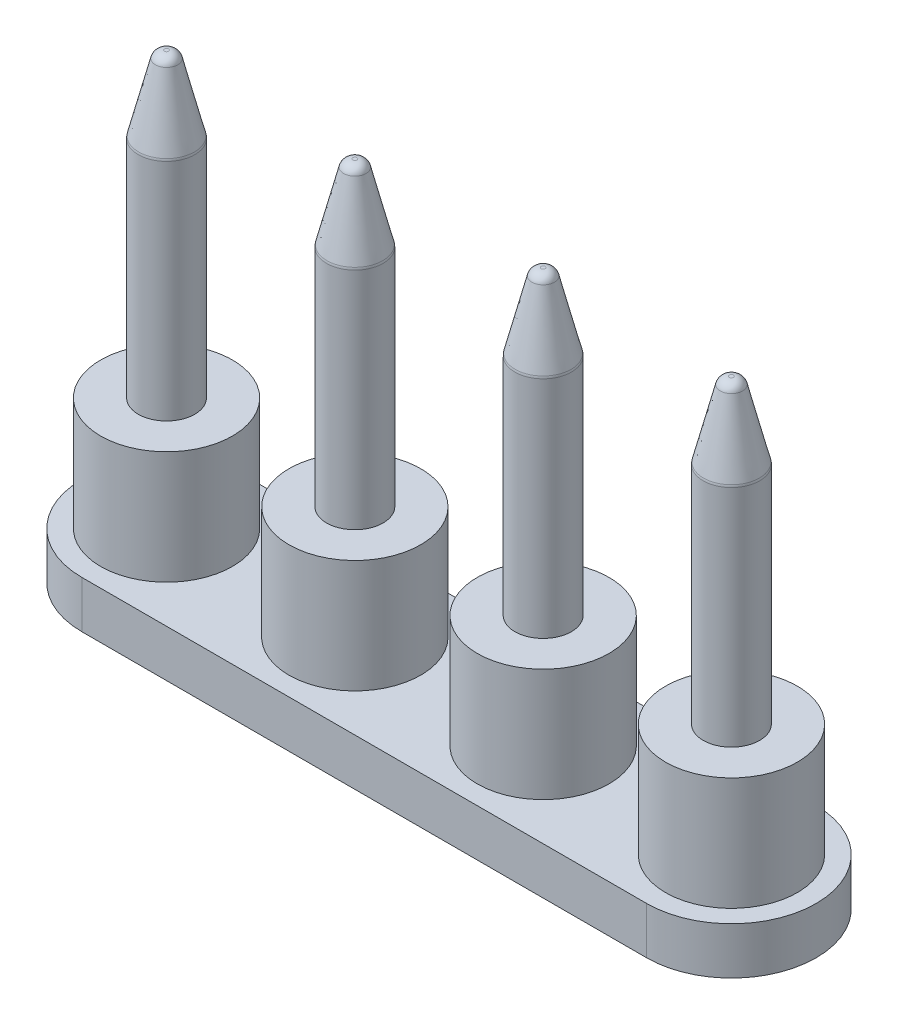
ISO-10303-21;
HEADER;
FILE_DESCRIPTION(('STEP AP214'),'2;1');
FILE_NAME('part.step','',(''),(''),'','','');
FILE_SCHEMA(('AUTOMOTIVE_DESIGN { 1 0 10303 214 1 1 1 1 }'));
ENDSEC;
DATA;
#1=APPLICATION_CONTEXT('core data for automotive mechanical design processes');
#2=APPLICATION_PROTOCOL_DEFINITION('international standard','automotive_design',2000,#1);
#3=PRODUCT_CONTEXT('',#1,'mechanical');
#4=PRODUCT('Part','Part','',(#3));
#5=PRODUCT_RELATED_PRODUCT_CATEGORY('part','',(#4));
#6=PRODUCT_DEFINITION_FORMATION('','',#4);
#7=PRODUCT_DEFINITION_CONTEXT('part definition',#1,'design');
#8=PRODUCT_DEFINITION('design','',#6,#7);
#9=PRODUCT_DEFINITION_SHAPE('','',#8);
#10=(LENGTH_UNIT() NAMED_UNIT(*) SI_UNIT(.MILLI.,.METRE.));
#11=(NAMED_UNIT(*) PLANE_ANGLE_UNIT() SI_UNIT($,.RADIAN.));
#12=(NAMED_UNIT(*) SI_UNIT($,.STERADIAN.) SOLID_ANGLE_UNIT());
#13=UNCERTAINTY_MEASURE_WITH_UNIT(LENGTH_MEASURE(1.E-05),#10,'distance_accuracy_value','');
#14=(GEOMETRIC_REPRESENTATION_CONTEXT(3) GLOBAL_UNCERTAINTY_ASSIGNED_CONTEXT((#13)) GLOBAL_UNIT_ASSIGNED_CONTEXT((#10,
#11,#12)) REPRESENTATION_CONTEXT('',''));
#15=CARTESIAN_POINT('',(0.,0.,0.));
#16=DIRECTION('',(0.,0.,1.));
#17=DIRECTION('',(1.,0.,0.));
#18=AXIS2_PLACEMENT_3D('',#15,#16,#17);
#19=CARTESIAN_POINT('',(15.,8.50000000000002,0.));
#20=DIRECTION('',(0.,1.,0.));
#21=DIRECTION('',(0.,0.,1.));
#22=AXIS2_PLACEMENT_3D('',#19,#20,#21);
#23=PLANE('',#22);
#24=CARTESIAN_POINT('',(15.,8.50000000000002,0.));
#25=DIRECTION('',(0.,1.,0.));
#26=DIRECTION('',(0.,0.,1.));
#27=AXIS2_PLACEMENT_3D('',#24,#25,#26);
#28=CIRCLE('',#27,3.5);
#29=CARTESIAN_POINT('',(15.,8.50000000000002,3.5));
#30=VERTEX_POINT('',#29);
#31=EDGE_CURVE('E142',#30,#30,#28,.T.);
#32=ORIENTED_EDGE('',*,*,#31,.T.);
#33=EDGE_LOOP('',(#32));
#34=FACE_BOUND('',#33,.T.);
#35=CARTESIAN_POINT('',(15.,8.50000000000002,0.));
#36=DIRECTION('',(0.,1.,0.));
#37=DIRECTION('',(0.,0.,1.));
#38=AXIS2_PLACEMENT_3D('',#35,#36,#37);
#39=CIRCLE('',#38,1.5);
#40=CARTESIAN_POINT('',(15.,8.50000000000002,1.5));
#41=VERTEX_POINT('',#40);
#42=EDGE_CURVE('E106',#41,#41,#39,.T.);
#43=ORIENTED_EDGE('',*,*,#42,.F.);
#44=EDGE_LOOP('',(#43));
#45=FACE_BOUND('',#44,.T.);
#46=ADVANCED_FACE('F31',(#34,#45),#23,.T.);
#47=CARTESIAN_POINT('',(-15.,2.5,-4.50000000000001));
#48=DIRECTION('',(0.,0.,1.));
#49=DIRECTION('',(1.,0.,0.));
#50=AXIS2_PLACEMENT_3D('',#47,#48,#49);
#51=PLANE('',#50);
#52=DIRECTION('',(-1.,0.,0.));
#53=VECTOR('',#52,1.);
#54=CARTESIAN_POINT('',(-15.,2.5,-4.50000000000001));
#55=LINE('',#54,#53);
#56=CARTESIAN_POINT('',(-2.9999803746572,2.5,-4.5));
#57=VERTEX_POINT('',#56);
#58=CARTESIAN_POINT('',(-15.,2.5,-4.50000000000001));
#59=VERTEX_POINT('',#58);
#60=EDGE_CURVE('E46',#57,#59,#55,.T.);
#61=ORIENTED_EDGE('',*,*,#60,.F.);
#62=DIRECTION('',(0.,-1.,0.));
#63=VECTOR('',#62,1.);
#64=CARTESIAN_POINT('',(-2.9999803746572,2.5,-4.5));
#65=LINE('',#64,#63);
#66=CARTESIAN_POINT('',(-2.9999803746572,0.,-4.5));
#67=VERTEX_POINT('',#66);
#68=EDGE_CURVE('E97',#57,#67,#65,.T.);
#69=ORIENTED_EDGE('',*,*,#68,.T.);
#70=DIRECTION('',(-1.,0.,0.));
#71=VECTOR('',#70,1.);
#72=CARTESIAN_POINT('',(-15.,0.,-4.5));
#73=LINE('',#72,#71);
#74=CARTESIAN_POINT('',(-15.,0.,-4.5));
#75=VERTEX_POINT('',#74);
#76=EDGE_CURVE('E86',#67,#75,#73,.T.);
#77=ORIENTED_EDGE('',*,*,#76,.T.);
#78=DIRECTION('',(0.,-1.,0.));
#79=VECTOR('',#78,1.);
#80=CARTESIAN_POINT('',(-15.,2.5,-4.50000000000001));
#81=LINE('',#80,#79);
#82=EDGE_CURVE('E158',#59,#75,#81,.T.);
#83=ORIENTED_EDGE('',*,*,#82,.F.);
#84=EDGE_LOOP('',(#61,#69,#77,#83));
#85=FACE_BOUND('',#84,.T.);
#86=ADVANCED_FACE('F98',(#85),#51,.F.);
#87=CARTESIAN_POINT('',(-15.,8.5,0.));
#88=DIRECTION('',(0.,1.,0.));
#89=DIRECTION('',(0.,0.,1.));
#90=AXIS2_PLACEMENT_3D('',#87,#88,#89);
#91=PLANE('',#90);
#92=CARTESIAN_POINT('',(-15.,8.5,0.));
#93=DIRECTION('',(0.,1.,0.));
#94=DIRECTION('',(0.,0.,1.));
#95=AXIS2_PLACEMENT_3D('',#92,#93,#94);
#96=CIRCLE('',#95,3.5);
#97=CARTESIAN_POINT('',(-15.,8.5,3.49999999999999));
#98=VERTEX_POINT('',#97);
#99=EDGE_CURVE('E136',#98,#98,#96,.T.);
#100=ORIENTED_EDGE('',*,*,#99,.T.);
#101=EDGE_LOOP('',(#100));
#102=FACE_BOUND('',#101,.T.);
#103=CARTESIAN_POINT('',(-15.,8.5,0.));
#104=DIRECTION('',(0.,1.,0.));
#105=DIRECTION('',(0.,0.,1.));
#106=AXIS2_PLACEMENT_3D('',#103,#104,#105);
#107=CIRCLE('',#106,1.5);
#108=CARTESIAN_POINT('',(-15.,8.5,1.49999999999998));
#109=VERTEX_POINT('',#108);
#110=EDGE_CURVE('E102',#109,#109,#107,.T.);
#111=ORIENTED_EDGE('',*,*,#110,.F.);
#112=EDGE_LOOP('',(#111));
#113=FACE_BOUND('',#112,.T.);
#114=ADVANCED_FACE('F232',(#102,#113),#91,.T.);
#115=CARTESIAN_POINT('',(-5.,8.5,0.));
#116=DIRECTION('',(0.,1.,0.));
#117=DIRECTION('',(0.,0.,1.));
#118=AXIS2_PLACEMENT_3D('',#115,#116,#117);
#119=PLANE('',#118);
#120=CARTESIAN_POINT('',(-5.,8.5,0.));
#121=DIRECTION('',(0.,1.,0.));
#122=DIRECTION('',(0.,0.,1.));
#123=AXIS2_PLACEMENT_3D('',#120,#121,#122);
#124=CIRCLE('',#123,3.5);
#125=CARTESIAN_POINT('',(-5.,8.5,3.5));
#126=VERTEX_POINT('',#125);
#127=EDGE_CURVE('E124',#126,#126,#124,.T.);
#128=ORIENTED_EDGE('',*,*,#127,.T.);
#129=EDGE_LOOP('',(#128));
#130=FACE_BOUND('',#129,.T.);
#131=CARTESIAN_POINT('',(-5.,8.5,0.));
#132=DIRECTION('',(0.,1.,0.));
#133=DIRECTION('',(0.,0.,1.));
#134=AXIS2_PLACEMENT_3D('',#131,#132,#133);
#135=CIRCLE('',#134,1.5);
#136=CARTESIAN_POINT('',(-5.,8.5,1.5));
#137=VERTEX_POINT('',#136);
#138=EDGE_CURVE('E115',#137,#137,#135,.T.);
#139=ORIENTED_EDGE('',*,*,#138,.F.);
#140=EDGE_LOOP('',(#139));
#141=FACE_BOUND('',#140,.T.);
#142=ADVANCED_FACE('F234',(#130,#141),#119,.T.);
#143=CARTESIAN_POINT('',(5.00000000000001,8.5,0.));
#144=DIRECTION('',(0.,1.,0.));
#145=DIRECTION('',(0.,0.,1.));
#146=AXIS2_PLACEMENT_3D('',#143,#144,#145);
#147=PLANE('',#146);
#148=CARTESIAN_POINT('',(5.00000000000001,8.5,0.));
#149=DIRECTION('',(0.,1.,0.));
#150=DIRECTION('',(0.,0.,1.));
#151=AXIS2_PLACEMENT_3D('',#148,#149,#150);
#152=CIRCLE('',#151,3.5);
#153=CARTESIAN_POINT('',(5.00000000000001,8.5,3.5));
#154=VERTEX_POINT('',#153);
#155=EDGE_CURVE('E130',#154,#154,#152,.T.);
#156=ORIENTED_EDGE('',*,*,#155,.T.);
#157=EDGE_LOOP('',(#156));
#158=FACE_BOUND('',#157,.T.);
#159=CARTESIAN_POINT('',(5.00000000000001,8.5,0.));
#160=DIRECTION('',(0.,1.,0.));
#161=DIRECTION('',(0.,0.,1.));
#162=AXIS2_PLACEMENT_3D('',#159,#160,#161);
#163=CIRCLE('',#162,1.5);
#164=CARTESIAN_POINT('',(5.00000000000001,8.5,1.5));
#165=VERTEX_POINT('',#164);
#166=EDGE_CURVE('E118',#165,#165,#163,.T.);
#167=ORIENTED_EDGE('',*,*,#166,.F.);
#168=EDGE_LOOP('',(#167));
#169=FACE_BOUND('',#168,.T.);
#170=ADVANCED_FACE('F241',(#158,#169),#147,.T.);
#171=CARTESIAN_POINT('',(-15.,2.5,0.));
#172=DIRECTION('',(0.,1.,0.));
#173=DIRECTION('',(0.,0.,1.));
#174=AXIS2_PLACEMENT_3D('',#171,#172,#173);
#175=PLANE('',#174);
#176=CARTESIAN_POINT('',(5.,2.5,0.));
#177=DIRECTION('',(0.,1.,0.));
#178=DIRECTION('',(0.,0.,1.));
#179=AXIS2_PLACEMENT_3D('',#176,#177,#178);
#180=CIRCLE('',#179,3.5);
#181=CARTESIAN_POINT('',(5.,2.5,3.5));
#182=VERTEX_POINT('',#181);
#183=EDGE_CURVE('E127',#182,#182,#180,.T.);
#184=ORIENTED_EDGE('',*,*,#183,.F.);
#185=EDGE_LOOP('',(#184));
#186=FACE_BOUND('',#185,.T.);
#187=CARTESIAN_POINT('',(15.,2.5,0.));
#188=DIRECTION('',(0.,1.,0.));
#189=DIRECTION('',(0.,0.,1.));
#190=AXIS2_PLACEMENT_3D('',#187,#188,#189);
#191=CIRCLE('',#190,3.5);
#192=CARTESIAN_POINT('',(15.,2.5,3.5));
#193=VERTEX_POINT('',#192);
#194=EDGE_CURVE('E139',#193,#193,#191,.T.);
#195=ORIENTED_EDGE('',*,*,#194,.F.);
#196=EDGE_LOOP('',(#195));
#197=FACE_BOUND('',#196,.T.);
#198=CARTESIAN_POINT('',(-15.,2.5,0.));
#199=DIRECTION('',(0.,1.,0.));
#200=DIRECTION('',(0.,0.,1.));
#201=AXIS2_PLACEMENT_3D('',#198,#199,#200);
#202=CIRCLE('',#201,4.5);
#203=CARTESIAN_POINT('',(-15.,2.5,4.5));
#204=VERTEX_POINT('',#203);
#205=EDGE_CURVE('E149',#59,#204,#202,.T.);
#206=ORIENTED_EDGE('',*,*,#205,.T.);
#207=DIRECTION('',(1.,0.,0.));
#208=VECTOR('',#207,1.);
#209=CARTESIAN_POINT('',(-15.,2.5,4.5));
#210=LINE('',#209,#208);
#211=CARTESIAN_POINT('',(15.,2.5,4.5));
#212=VERTEX_POINT('',#211);
#213=EDGE_CURVE('E152',#204,#212,#210,.T.);
#214=ORIENTED_EDGE('',*,*,#213,.T.);
#215=CARTESIAN_POINT('',(15.,2.5,0.));
#216=DIRECTION('',(0.,1.,0.));
#217=DIRECTION('',(0.,0.,-1.));
#218=AXIS2_PLACEMENT_3D('',#215,#216,#217);
#219=CIRCLE('',#218,4.5);
#220=CARTESIAN_POINT('',(15.,2.5,-4.5));
#221=VERTEX_POINT('',#220);
#222=EDGE_CURVE('E154',#212,#221,#219,.T.);
#223=ORIENTED_EDGE('',*,*,#222,.T.);
#224=CARTESIAN_POINT('',(2.9999803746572,2.5,-4.5));
#225=VERTEX_POINT('',#224);
#226=EDGE_CURVE('E156',#221,#225,#55,.T.);
#227=ORIENTED_EDGE('',*,*,#226,.T.);
#228=CARTESIAN_POINT('',(0.,2.5,-4.51085134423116));
#229=DIRECTION('',(0.,-1.,0.));
#230=DIRECTION('',(0.,0.,1.));
#231=AXIS2_PLACEMENT_3D('',#228,#229,#230);
#232=CIRCLE('',#231,3.);
#233=EDGE_CURVE('E105',#57,#225,#232,.T.);
#234=ORIENTED_EDGE('',*,*,#233,.F.);
#235=ORIENTED_EDGE('',*,*,#60,.T.);
#236=EDGE_LOOP('',(#206,#214,#223,#227,#234,#235));
#237=FACE_BOUND('',#236,.T.);
#238=CARTESIAN_POINT('',(-15.,2.5,0.));
#239=DIRECTION('',(0.,1.,0.));
#240=DIRECTION('',(0.,0.,1.));
#241=AXIS2_PLACEMENT_3D('',#238,#239,#240);
#242=CIRCLE('',#241,3.5);
#243=CARTESIAN_POINT('',(-15.,2.5,3.49999999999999));
#244=VERTEX_POINT('',#243);
#245=EDGE_CURVE('E133',#244,#244,#242,.T.);
#246=ORIENTED_EDGE('',*,*,#245,.F.);
#247=EDGE_LOOP('',(#246));
#248=FACE_BOUND('',#247,.T.);
#249=CARTESIAN_POINT('',(-5.,2.5,0.));
#250=DIRECTION('',(0.,1.,0.));
#251=DIRECTION('',(0.,0.,1.));
#252=AXIS2_PLACEMENT_3D('',#249,#250,#251);
#253=CIRCLE('',#252,3.5);
#254=CARTESIAN_POINT('',(-5.,2.5,3.5));
#255=VERTEX_POINT('',#254);
#256=EDGE_CURVE('E121',#255,#255,#253,.T.);
#257=ORIENTED_EDGE('',*,*,#256,.F.);
#258=EDGE_LOOP('',(#257));
#259=FACE_BOUND('',#258,.T.);
#260=ADVANCED_FACE('F262',(#186,#197,#237,#248,#259),#175,.T.);
#261=CARTESIAN_POINT('',(-15.,2.5,0.));
#262=DIRECTION('',(0.,-1.,0.));
#263=DIRECTION('',(0.,0.,-1.));
#264=AXIS2_PLACEMENT_3D('',#261,#262,#263);
#265=CYLINDRICAL_SURFACE('',#264,4.5);
#266=CARTESIAN_POINT('',(-15.,0.,0.));
#267=DIRECTION('',(0.,1.,0.));
#268=DIRECTION('',(0.,0.,1.));
#269=AXIS2_PLACEMENT_3D('',#266,#267,#268);
#270=CIRCLE('',#269,4.5);
#271=CARTESIAN_POINT('',(-15.,0.,4.5));
#272=VERTEX_POINT('',#271);
#273=EDGE_CURVE('E92',#75,#272,#270,.T.);
#274=ORIENTED_EDGE('',*,*,#273,.T.);
#275=DIRECTION('',(0.,-1.,0.));
#276=VECTOR('',#275,1.);
#277=CARTESIAN_POINT('',(-15.,2.5,4.5));
#278=LINE('',#277,#276);
#279=EDGE_CURVE('E166',#204,#272,#278,.T.);
#280=ORIENTED_EDGE('',*,*,#279,.F.);
#281=ORIENTED_EDGE('',*,*,#205,.F.);
#282=ORIENTED_EDGE('',*,*,#82,.T.);
#283=EDGE_LOOP('',(#274,#280,#281,#282));
#284=FACE_BOUND('',#283,.T.);
#285=ADVANCED_FACE('F33',(#284),#265,.T.);
#286=CARTESIAN_POINT('',(-15.,2.5,4.5));
#287=DIRECTION('',(0.,0.,-1.));
#288=DIRECTION('',(-1.,0.,0.));
#289=AXIS2_PLACEMENT_3D('',#286,#287,#288);
#290=PLANE('',#289);
#291=DIRECTION('',(1.,0.,0.));
#292=VECTOR('',#291,1.);
#293=CARTESIAN_POINT('',(-15.,0.,4.5));
#294=LINE('',#293,#292);
#295=CARTESIAN_POINT('',(15.,0.,4.5));
#296=VERTEX_POINT('',#295);
#297=EDGE_CURVE('E146',#272,#296,#294,.T.);
#298=ORIENTED_EDGE('',*,*,#297,.T.);
#299=DIRECTION('',(0.,-1.,0.));
#300=VECTOR('',#299,1.);
#301=CARTESIAN_POINT('',(15.,2.5,4.5));
#302=LINE('',#301,#300);
#303=EDGE_CURVE('E163',#212,#296,#302,.T.);
#304=ORIENTED_EDGE('',*,*,#303,.F.);
#305=ORIENTED_EDGE('',*,*,#213,.F.);
#306=ORIENTED_EDGE('',*,*,#279,.T.);
#307=EDGE_LOOP('',(#298,#304,#305,#306));
#308=FACE_BOUND('',#307,.T.);
#309=ADVANCED_FACE('F269',(#308),#290,.F.);
#310=CARTESIAN_POINT('',(15.,2.5,0.));
#311=DIRECTION('',(0.,-1.,0.));
#312=DIRECTION('',(0.,0.,-1.));
#313=AXIS2_PLACEMENT_3D('',#310,#311,#312);
#314=CYLINDRICAL_SURFACE('',#313,4.5);
#315=CARTESIAN_POINT('',(15.,0.,0.));
#316=DIRECTION('',(0.,1.,0.));
#317=DIRECTION('',(0.,0.,-1.));
#318=AXIS2_PLACEMENT_3D('',#315,#316,#317);
#319=CIRCLE('',#318,4.5);
#320=CARTESIAN_POINT('',(15.,0.,-4.5));
#321=VERTEX_POINT('',#320);
#322=EDGE_CURVE('E95',#296,#321,#319,.T.);
#323=ORIENTED_EDGE('',*,*,#322,.T.);
#324=DIRECTION('',(0.,-1.,0.));
#325=VECTOR('',#324,1.);
#326=CARTESIAN_POINT('',(15.,2.5,-4.5));
#327=LINE('',#326,#325);
#328=EDGE_CURVE('E160',#221,#321,#327,.T.);
#329=ORIENTED_EDGE('',*,*,#328,.F.);
#330=ORIENTED_EDGE('',*,*,#222,.F.);
#331=ORIENTED_EDGE('',*,*,#303,.T.);
#332=EDGE_LOOP('',(#323,#329,#330,#331));
#333=FACE_BOUND('',#332,.T.);
#334=ADVANCED_FACE('F267',(#333),#314,.T.);
#335=CARTESIAN_POINT('',(2.9999803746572,0.,-4.5));
#336=VERTEX_POINT('',#335);
#337=EDGE_CURVE('E94',#321,#336,#73,.T.);
#338=ORIENTED_EDGE('',*,*,#337,.T.);
#339=DIRECTION('',(0.,-1.,0.));
#340=VECTOR('',#339,1.);
#341=CARTESIAN_POINT('',(2.9999803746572,2.5,-4.5));
#342=LINE('',#341,#340);
#343=EDGE_CURVE('E54',#225,#336,#342,.T.);
#344=ORIENTED_EDGE('',*,*,#343,.F.);
#345=ORIENTED_EDGE('',*,*,#226,.F.);
#346=ORIENTED_EDGE('',*,*,#328,.T.);
#347=EDGE_LOOP('',(#338,#344,#345,#346));
#348=FACE_BOUND('',#347,.T.);
#349=ADVANCED_FACE('F245',(#348),#51,.F.);
#350=CARTESIAN_POINT('',(-15.,0.,0.));
#351=DIRECTION('',(0.,1.,0.));
#352=DIRECTION('',(0.,0.,1.));
#353=AXIS2_PLACEMENT_3D('',#350,#351,#352);
#354=PLANE('',#353);
#355=ORIENTED_EDGE('',*,*,#273,.F.);
#356=ORIENTED_EDGE('',*,*,#76,.F.);
#357=CARTESIAN_POINT('',(0.,0.,-4.51085134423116));
#358=DIRECTION('',(0.,-1.,0.));
#359=DIRECTION('',(0.,0.,1.));
#360=AXIS2_PLACEMENT_3D('',#357,#358,#359);
#361=CIRCLE('',#360,3.);
#362=EDGE_CURVE('E90',#67,#336,#361,.T.);
#363=ORIENTED_EDGE('',*,*,#362,.T.);
#364=ORIENTED_EDGE('',*,*,#337,.F.);
#365=ORIENTED_EDGE('',*,*,#322,.F.);
#366=ORIENTED_EDGE('',*,*,#297,.F.);
#367=EDGE_LOOP('',(#355,#356,#363,#364,#365,#366));
#368=FACE_BOUND('',#367,.T.);
#369=ADVANCED_FACE('F87',(#368),#354,.F.);
#370=CARTESIAN_POINT('',(15.,8.50000000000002,0.));
#371=DIRECTION('',(0.,-1.,0.));
#372=DIRECTION('',(0.,0.,-1.));
#373=AXIS2_PLACEMENT_3D('',#370,#371,#372);
#374=CYLINDRICAL_SURFACE('',#373,3.5);
#375=ORIENTED_EDGE('',*,*,#31,.F.);
#376=EDGE_LOOP('',(#375));
#377=FACE_BOUND('',#376,.T.);
#378=ORIENTED_EDGE('',*,*,#194,.T.);
#379=EDGE_LOOP('',(#378));
#380=FACE_BOUND('',#379,.T.);
#381=ADVANCED_FACE('F256',(#377,#380),#374,.T.);
#382=CARTESIAN_POINT('',(-15.,8.5,0.));
#383=DIRECTION('',(0.,-1.,0.));
#384=DIRECTION('',(0.,0.,-1.));
#385=AXIS2_PLACEMENT_3D('',#382,#383,#384);
#386=CYLINDRICAL_SURFACE('',#385,3.5);
#387=ORIENTED_EDGE('',*,*,#99,.F.);
#388=EDGE_LOOP('',(#387));
#389=FACE_BOUND('',#388,.T.);
#390=ORIENTED_EDGE('',*,*,#245,.T.);
#391=EDGE_LOOP('',(#390));
#392=FACE_BOUND('',#391,.T.);
#393=ADVANCED_FACE('F255',(#389,#392),#386,.T.);
#394=CARTESIAN_POINT('',(5.00000000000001,8.5,0.));
#395=DIRECTION('',(0.,-1.,0.));
#396=DIRECTION('',(0.,0.,-1.));
#397=AXIS2_PLACEMENT_3D('',#394,#395,#396);
#398=CYLINDRICAL_SURFACE('',#397,3.5);
#399=ORIENTED_EDGE('',*,*,#155,.F.);
#400=EDGE_LOOP('',(#399));
#401=FACE_BOUND('',#400,.T.);
#402=ORIENTED_EDGE('',*,*,#183,.T.);
#403=EDGE_LOOP('',(#402));
#404=FACE_BOUND('',#403,.T.);
#405=ADVANCED_FACE('F292',(#401,#404),#398,.T.);
#406=CARTESIAN_POINT('',(-5.,8.5,0.));
#407=DIRECTION('',(0.,-1.,0.));
#408=DIRECTION('',(0.,0.,-1.));
#409=AXIS2_PLACEMENT_3D('',#406,#407,#408);
#410=CYLINDRICAL_SURFACE('',#409,3.5);
#411=ORIENTED_EDGE('',*,*,#127,.F.);
#412=EDGE_LOOP('',(#411));
#413=FACE_BOUND('',#412,.T.);
#414=ORIENTED_EDGE('',*,*,#256,.T.);
#415=EDGE_LOOP('',(#414));
#416=FACE_BOUND('',#415,.T.);
#417=ADVANCED_FACE('F289',(#413,#416),#410,.T.);
#418=CARTESIAN_POINT('',(5.00000000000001,24.5,0.));
#419=DIRECTION('',(0.,-1.,0.));
#420=DIRECTION('',(0.,0.,-1.));
#421=AXIS2_PLACEMENT_3D('',#418,#419,#420);
#422=CYLINDRICAL_SURFACE('',#421,1.5);
#423=CARTESIAN_POINT('',(5.00000000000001,20.4384471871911,0.));
#424=DIRECTION('',(0.,1.,0.));
#425=DIRECTION('',(0.,0.,1.));
#426=AXIS2_PLACEMENT_3D('',#423,#424,#425);
#427=CIRCLE('',#426,1.5);
#428=CARTESIAN_POINT('',(5.00000000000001,20.4384471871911,1.5));
#429=VERTEX_POINT('',#428);
#430=EDGE_CURVE('E178',#429,#429,#427,.F.);
#431=ORIENTED_EDGE('',*,*,#430,.T.);
#432=EDGE_LOOP('',(#431));
#433=FACE_BOUND('',#432,.T.);
#434=ORIENTED_EDGE('',*,*,#166,.T.);
#435=EDGE_LOOP('',(#434));
#436=FACE_BOUND('',#435,.T.);
#437=ADVANCED_FACE('F291',(#433,#436),#422,.T.);
#438=CARTESIAN_POINT('',(5.00000000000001,24.5,0.));
#439=DIRECTION('',(0.,1.,0.));
#440=DIRECTION('',(0.,0.,1.));
#441=AXIS2_PLACEMENT_3D('',#438,#439,#440);
#442=PLANE('',#441);
#443=CARTESIAN_POINT('',(5.00000000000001,24.5,0.));
#444=DIRECTION('',(0.,1.,0.));
#445=DIRECTION('',(0.,0.,1.));
#446=AXIS2_PLACEMENT_3D('',#443,#444,#445);
#447=CIRCLE('',#446,0.109611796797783);
#448=CARTESIAN_POINT('',(5.00000000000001,24.5,0.109611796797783));
#449=VERTEX_POINT('',#448);
#450=EDGE_CURVE('E199',#449,#449,#447,.T.);
#451=ORIENTED_EDGE('',*,*,#450,.T.);
#452=EDGE_LOOP('',(#451));
#453=FACE_BOUND('',#452,.T.);
#454=ADVANCED_FACE('F299',(#453),#442,.T.);
#455=CARTESIAN_POINT('',(-4.99999999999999,24.5,0.));
#456=DIRECTION('',(0.,-1.,0.));
#457=DIRECTION('',(0.,0.,-1.));
#458=AXIS2_PLACEMENT_3D('',#455,#456,#457);
#459=CYLINDRICAL_SURFACE('',#458,1.5);
#460=CARTESIAN_POINT('',(-4.99999999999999,20.4384471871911,0.));
#461=DIRECTION('',(0.,1.,0.));
#462=DIRECTION('',(0.,0.,1.));
#463=AXIS2_PLACEMENT_3D('',#460,#461,#462);
#464=CIRCLE('',#463,1.5);
#465=CARTESIAN_POINT('',(-4.99999999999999,20.4384471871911,1.5));
#466=VERTEX_POINT('',#465);
#467=EDGE_CURVE('E169',#466,#466,#464,.F.);
#468=ORIENTED_EDGE('',*,*,#467,.T.);
#469=EDGE_LOOP('',(#468));
#470=FACE_BOUND('',#469,.T.);
#471=ORIENTED_EDGE('',*,*,#138,.T.);
#472=EDGE_LOOP('',(#471));
#473=FACE_BOUND('',#472,.T.);
#474=ADVANCED_FACE('F490',(#470,#473),#459,.T.);
#475=CARTESIAN_POINT('',(-4.99999999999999,24.5,0.));
#476=DIRECTION('',(0.,1.,0.));
#477=DIRECTION('',(0.,0.,1.));
#478=AXIS2_PLACEMENT_3D('',#475,#476,#477);
#479=PLANE('',#478);
#480=CARTESIAN_POINT('',(-4.99999999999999,24.5,0.));
#481=DIRECTION('',(0.,1.,0.));
#482=DIRECTION('',(0.,0.,1.));
#483=AXIS2_PLACEMENT_3D('',#480,#481,#482);
#484=CIRCLE('',#483,0.109611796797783);
#485=CARTESIAN_POINT('',(-4.99999999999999,24.5,0.109611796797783));
#486=VERTEX_POINT('',#485);
#487=EDGE_CURVE('E202',#486,#486,#484,.T.);
#488=ORIENTED_EDGE('',*,*,#487,.T.);
#489=EDGE_LOOP('',(#488));
#490=FACE_BOUND('',#489,.T.);
#491=ADVANCED_FACE('F228',(#490),#479,.T.);
#492=CARTESIAN_POINT('',(-15.,24.5,0.));
#493=DIRECTION('',(0.,-1.,0.));
#494=DIRECTION('',(0.,0.,-1.));
#495=AXIS2_PLACEMENT_3D('',#492,#493,#494);
#496=CYLINDRICAL_SURFACE('',#495,1.5);
#497=CARTESIAN_POINT('',(-15.,20.4384471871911,0.));
#498=DIRECTION('',(0.,1.,0.));
#499=DIRECTION('',(0.,0.,1.));
#500=AXIS2_PLACEMENT_3D('',#497,#498,#499);
#501=CIRCLE('',#500,1.5);
#502=CARTESIAN_POINT('',(-15.,20.4384471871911,1.49999999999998));
#503=VERTEX_POINT('',#502);
#504=EDGE_CURVE('E205',#503,#503,#501,.F.);
#505=ORIENTED_EDGE('',*,*,#504,.T.);
#506=EDGE_LOOP('',(#505));
#507=FACE_BOUND('',#506,.T.);
#508=ORIENTED_EDGE('',*,*,#110,.T.);
#509=EDGE_LOOP('',(#508));
#510=FACE_BOUND('',#509,.T.);
#511=ADVANCED_FACE('F224',(#507,#510),#496,.T.);
#512=CARTESIAN_POINT('',(-15.,24.5,0.));
#513=DIRECTION('',(0.,1.,0.));
#514=DIRECTION('',(0.,0.,1.));
#515=AXIS2_PLACEMENT_3D('',#512,#513,#514);
#516=PLANE('',#515);
#517=CARTESIAN_POINT('',(-15.,24.5,0.));
#518=DIRECTION('',(0.,1.,0.));
#519=DIRECTION('',(0.,0.,1.));
#520=AXIS2_PLACEMENT_3D('',#517,#518,#519);
#521=CIRCLE('',#520,0.109611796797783);
#522=CARTESIAN_POINT('',(-15.,24.5,0.109611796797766));
#523=VERTEX_POINT('',#522);
#524=EDGE_CURVE('E11',#523,#523,#521,.T.);
#525=ORIENTED_EDGE('',*,*,#524,.T.);
#526=EDGE_LOOP('',(#525));
#527=FACE_BOUND('',#526,.T.);
#528=ADVANCED_FACE('F227',(#527),#516,.T.);
#529=CARTESIAN_POINT('',(0.,2.5,-4.51085134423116));
#530=DIRECTION('',(0.,-1.,0.));
#531=DIRECTION('',(0.,0.,-1.));
#532=AXIS2_PLACEMENT_3D('',#529,#530,#531);
#533=CYLINDRICAL_SURFACE('',#532,3.);
#534=ORIENTED_EDGE('',*,*,#362,.F.);
#535=ORIENTED_EDGE('',*,*,#68,.F.);
#536=ORIENTED_EDGE('',*,*,#233,.T.);
#537=ORIENTED_EDGE('',*,*,#343,.T.);
#538=EDGE_LOOP('',(#534,#535,#536,#537));
#539=FACE_BOUND('',#538,.T.);
#540=ADVANCED_FACE('F104',(#539),#533,.T.);
#541=CARTESIAN_POINT('',(15.,24.5,0.));
#542=DIRECTION('',(0.,-1.,0.));
#543=DIRECTION('',(0.,0.,-1.));
#544=AXIS2_PLACEMENT_3D('',#541,#542,#543);
#545=CYLINDRICAL_SURFACE('',#544,1.5);
#546=CARTESIAN_POINT('',(15.,20.4384471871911,0.));
#547=DIRECTION('',(0.,1.,0.));
#548=DIRECTION('',(0.,0.,1.));
#549=AXIS2_PLACEMENT_3D('',#546,#547,#548);
#550=CIRCLE('',#549,1.5);
#551=CARTESIAN_POINT('',(15.,20.4384471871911,1.49999999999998));
#552=VERTEX_POINT('',#551);
#553=EDGE_CURVE('E187',#552,#552,#550,.F.);
#554=ORIENTED_EDGE('',*,*,#553,.T.);
#555=EDGE_LOOP('',(#554));
#556=FACE_BOUND('',#555,.T.);
#557=ORIENTED_EDGE('',*,*,#42,.T.);
#558=EDGE_LOOP('',(#557));
#559=FACE_BOUND('',#558,.T.);
#560=ADVANCED_FACE('F374',(#556,#559),#545,.T.);
#561=CARTESIAN_POINT('',(15.,24.5,0.));
#562=DIRECTION('',(0.,1.,0.));
#563=DIRECTION('',(0.,0.,1.));
#564=AXIS2_PLACEMENT_3D('',#561,#562,#563);
#565=PLANE('',#564);
#566=CARTESIAN_POINT('',(15.,24.5,0.));
#567=DIRECTION('',(0.,1.,0.));
#568=DIRECTION('',(0.,0.,1.));
#569=AXIS2_PLACEMENT_3D('',#566,#567,#568);
#570=CIRCLE('',#569,0.109611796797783);
#571=CARTESIAN_POINT('',(15.,24.5,0.109611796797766));
#572=VERTEX_POINT('',#571);
#573=EDGE_CURVE('E196',#572,#572,#570,.T.);
#574=ORIENTED_EDGE('',*,*,#573,.T.);
#575=EDGE_LOOP('',(#574));
#576=FACE_BOUND('',#575,.T.);
#577=ADVANCED_FACE('F385',(#576),#565,.T.);
#578=CARTESIAN_POINT('',(15.,24.5,0.));
#579=DIRECTION('',(0.,-1.,0.));
#580=DIRECTION('',(0.,0.,-1.));
#581=AXIS2_PLACEMENT_3D('',#578,#579,#580);
#582=CONICAL_SURFACE('',#581,0.499999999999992,0.244978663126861);
#583=CARTESIAN_POINT('',(15.,20.5597149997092,0.));
#584=DIRECTION('',(0.,-1.,0.));
#585=DIRECTION('',(0.,0.,-1.));
#586=AXIS2_PLACEMENT_3D('',#583,#584,#585);
#587=CIRCLE('',#586,1.48507125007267);
#588=CARTESIAN_POINT('',(15.,20.5597149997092,-1.48507125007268));
#589=VERTEX_POINT('',#588);
#590=EDGE_CURVE('E193',#589,#589,#587,.F.);
#591=ORIENTED_EDGE('',*,*,#590,.T.);
#592=EDGE_LOOP('',(#591));
#593=FACE_BOUND('',#592,.T.);
#594=CARTESIAN_POINT('',(15.,24.1212678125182,0.));
#595=DIRECTION('',(0.,1.,0.));
#596=DIRECTION('',(0.,0.,1.));
#597=AXIS2_PLACEMENT_3D('',#594,#595,#596);
#598=CIRCLE('',#597,0.594683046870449);
#599=CARTESIAN_POINT('',(15.,24.1212678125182,0.594683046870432));
#600=VERTEX_POINT('',#599);
#601=EDGE_CURVE('E190',#600,#600,#598,.F.);
#602=ORIENTED_EDGE('',*,*,#601,.T.);
#603=EDGE_LOOP('',(#602));
#604=FACE_BOUND('',#603,.T.);
#605=ADVANCED_FACE('F393',(#593,#604),#582,.T.);
#606=CARTESIAN_POINT('',(5.00000000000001,24.5,0.));
#607=DIRECTION('',(0.,-1.,0.));
#608=DIRECTION('',(0.,0.,-1.));
#609=AXIS2_PLACEMENT_3D('',#606,#607,#608);
#610=CONICAL_SURFACE('',#609,0.499999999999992,0.244978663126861);
#611=CARTESIAN_POINT('',(5.00000000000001,20.5597149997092,0.));
#612=DIRECTION('',(0.,-1.,0.));
#613=DIRECTION('',(0.,0.,-1.));
#614=AXIS2_PLACEMENT_3D('',#611,#612,#613);
#615=CIRCLE('',#614,1.48507125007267);
#616=CARTESIAN_POINT('',(5.00000000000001,20.5597149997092,-1.48507125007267));
#617=VERTEX_POINT('',#616);
#618=EDGE_CURVE('E184',#617,#617,#615,.F.);
#619=ORIENTED_EDGE('',*,*,#618,.T.);
#620=EDGE_LOOP('',(#619));
#621=FACE_BOUND('',#620,.T.);
#622=CARTESIAN_POINT('',(5.00000000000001,24.1212678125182,0.));
#623=DIRECTION('',(0.,1.,0.));
#624=DIRECTION('',(0.,0.,1.));
#625=AXIS2_PLACEMENT_3D('',#622,#623,#624);
#626=CIRCLE('',#625,0.594683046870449);
#627=CARTESIAN_POINT('',(5.00000000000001,24.1212678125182,0.594683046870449));
#628=VERTEX_POINT('',#627);
#629=EDGE_CURVE('E181',#628,#628,#626,.F.);
#630=ORIENTED_EDGE('',*,*,#629,.T.);
#631=EDGE_LOOP('',(#630));
#632=FACE_BOUND('',#631,.T.);
#633=ADVANCED_FACE('F401',(#621,#632),#610,.T.);
#634=CARTESIAN_POINT('',(-4.99999999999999,24.5,0.));
#635=DIRECTION('',(0.,-1.,0.));
#636=DIRECTION('',(0.,0.,-1.));
#637=AXIS2_PLACEMENT_3D('',#634,#635,#636);
#638=CONICAL_SURFACE('',#637,0.499999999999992,0.244978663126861);
#639=CARTESIAN_POINT('',(-4.99999999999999,20.5597149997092,0.));
#640=DIRECTION('',(0.,-1.,0.));
#641=DIRECTION('',(0.,0.,-1.));
#642=AXIS2_PLACEMENT_3D('',#639,#640,#641);
#643=CIRCLE('',#642,1.48507125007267);
#644=CARTESIAN_POINT('',(-4.99999999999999,20.5597149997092,-1.48507125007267));
#645=VERTEX_POINT('',#644);
#646=EDGE_CURVE('E175',#645,#645,#643,.F.);
#647=ORIENTED_EDGE('',*,*,#646,.T.);
#648=EDGE_LOOP('',(#647));
#649=FACE_BOUND('',#648,.T.);
#650=CARTESIAN_POINT('',(-4.99999999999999,24.1212678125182,0.));
#651=DIRECTION('',(0.,1.,0.));
#652=DIRECTION('',(0.,0.,1.));
#653=AXIS2_PLACEMENT_3D('',#650,#651,#652);
#654=CIRCLE('',#653,0.594683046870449);
#655=CARTESIAN_POINT('',(-4.99999999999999,24.1212678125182,0.594683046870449));
#656=VERTEX_POINT('',#655);
#657=EDGE_CURVE('E172',#656,#656,#654,.F.);
#658=ORIENTED_EDGE('',*,*,#657,.T.);
#659=EDGE_LOOP('',(#658));
#660=FACE_BOUND('',#659,.T.);
#661=ADVANCED_FACE('F409',(#649,#660),#638,.T.);
#662=CARTESIAN_POINT('',(-15.,24.5,0.));
#663=DIRECTION('',(0.,-1.,0.));
#664=DIRECTION('',(0.,0.,-1.));
#665=AXIS2_PLACEMENT_3D('',#662,#663,#664);
#666=CONICAL_SURFACE('',#665,0.499999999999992,0.244978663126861);
#667=CARTESIAN_POINT('',(-15.,20.5597149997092,0.));
#668=DIRECTION('',(0.,-1.,0.));
#669=DIRECTION('',(0.,0.,-1.));
#670=AXIS2_PLACEMENT_3D('',#667,#668,#669);
#671=CIRCLE('',#670,1.48507125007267);
#672=CARTESIAN_POINT('',(-15.,20.5597149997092,-1.48507125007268));
#673=VERTEX_POINT('',#672);
#674=EDGE_CURVE('E39',#673,#673,#671,.F.);
#675=ORIENTED_EDGE('',*,*,#674,.T.);
#676=EDGE_LOOP('',(#675));
#677=FACE_BOUND('',#676,.T.);
#678=CARTESIAN_POINT('',(-15.,24.1212678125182,0.));
#679=DIRECTION('',(0.,1.,0.));
#680=DIRECTION('',(0.,0.,1.));
#681=AXIS2_PLACEMENT_3D('',#678,#679,#680);
#682=CIRCLE('',#681,0.594683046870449);
#683=CARTESIAN_POINT('',(-15.,24.1212678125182,0.594683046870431));
#684=VERTEX_POINT('',#683);
#685=EDGE_CURVE('E208',#684,#684,#682,.F.);
#686=ORIENTED_EDGE('',*,*,#685,.T.);
#687=EDGE_LOOP('',(#686));
#688=FACE_BOUND('',#687,.T.);
#689=ADVANCED_FACE('F213',(#677,#688),#666,.T.);
#690=CARTESIAN_POINT('',(-4.99999999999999,20.4384471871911,0.));
#691=DIRECTION('',(0.,1.,0.));
#692=DIRECTION('',(0.,0.,1.));
#693=AXIS2_PLACEMENT_3D('',#690,#691,#692);
#694=TOROIDAL_SURFACE('',#693,1.,0.5);
#695=ORIENTED_EDGE('',*,*,#646,.F.);
#696=EDGE_LOOP('',(#695));
#697=FACE_BOUND('',#696,.T.);
#698=ORIENTED_EDGE('',*,*,#467,.F.);
#699=EDGE_LOOP('',(#698));
#700=FACE_BOUND('',#699,.T.);
#701=ADVANCED_FACE('F424',(#697,#700),#694,.T.);
#702=CARTESIAN_POINT('',(5.00000000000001,20.4384471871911,0.));
#703=DIRECTION('',(0.,1.,0.));
#704=DIRECTION('',(0.,0.,1.));
#705=AXIS2_PLACEMENT_3D('',#702,#703,#704);
#706=TOROIDAL_SURFACE('',#705,1.,0.5);
#707=ORIENTED_EDGE('',*,*,#618,.F.);
#708=EDGE_LOOP('',(#707));
#709=FACE_BOUND('',#708,.T.);
#710=ORIENTED_EDGE('',*,*,#430,.F.);
#711=EDGE_LOOP('',(#710));
#712=FACE_BOUND('',#711,.T.);
#713=ADVANCED_FACE('F431',(#709,#712),#706,.T.);
#714=CARTESIAN_POINT('',(15.,20.4384471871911,0.));
#715=DIRECTION('',(0.,1.,0.));
#716=DIRECTION('',(0.,0.,1.));
#717=AXIS2_PLACEMENT_3D('',#714,#715,#716);
#718=TOROIDAL_SURFACE('',#717,1.,0.5);
#719=ORIENTED_EDGE('',*,*,#590,.F.);
#720=EDGE_LOOP('',(#719));
#721=FACE_BOUND('',#720,.T.);
#722=ORIENTED_EDGE('',*,*,#553,.F.);
#723=EDGE_LOOP('',(#722));
#724=FACE_BOUND('',#723,.T.);
#725=ADVANCED_FACE('F439',(#721,#724),#718,.T.);
#726=CARTESIAN_POINT('',(15.,24.,0.));
#727=DIRECTION('',(0.,1.,0.));
#728=DIRECTION('',(0.,0.,1.));
#729=AXIS2_PLACEMENT_3D('',#726,#727,#728);
#730=DEGENERATE_TOROIDAL_SURFACE('',#729,0.109611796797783,0.5,.T.);
#731=ORIENTED_EDGE('',*,*,#601,.F.);
#732=EDGE_LOOP('',(#731));
#733=FACE_BOUND('',#732,.T.);
#734=ORIENTED_EDGE('',*,*,#573,.F.);
#735=EDGE_LOOP('',(#734));
#736=FACE_BOUND('',#735,.T.);
#737=ADVANCED_FACE('F447',(#733,#736),#730,.T.);
#738=CARTESIAN_POINT('',(5.00000000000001,24.,0.));
#739=DIRECTION('',(0.,1.,0.));
#740=DIRECTION('',(0.,0.,1.));
#741=AXIS2_PLACEMENT_3D('',#738,#739,#740);
#742=DEGENERATE_TOROIDAL_SURFACE('',#741,0.109611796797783,0.5,.T.);
#743=ORIENTED_EDGE('',*,*,#629,.F.);
#744=EDGE_LOOP('',(#743));
#745=FACE_BOUND('',#744,.T.);
#746=ORIENTED_EDGE('',*,*,#450,.F.);
#747=EDGE_LOOP('',(#746));
#748=FACE_BOUND('',#747,.T.);
#749=ADVANCED_FACE('F455',(#745,#748),#742,.T.);
#750=CARTESIAN_POINT('',(-4.99999999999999,24.,0.));
#751=DIRECTION('',(0.,1.,0.));
#752=DIRECTION('',(0.,0.,1.));
#753=AXIS2_PLACEMENT_3D('',#750,#751,#752);
#754=DEGENERATE_TOROIDAL_SURFACE('',#753,0.109611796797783,0.5,.T.);
#755=ORIENTED_EDGE('',*,*,#657,.F.);
#756=EDGE_LOOP('',(#755));
#757=FACE_BOUND('',#756,.T.);
#758=ORIENTED_EDGE('',*,*,#487,.F.);
#759=EDGE_LOOP('',(#758));
#760=FACE_BOUND('',#759,.T.);
#761=ADVANCED_FACE('F220',(#757,#760),#754,.T.);
#762=CARTESIAN_POINT('',(-15.,20.4384471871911,0.));
#763=DIRECTION('',(0.,1.,0.));
#764=DIRECTION('',(0.,0.,1.));
#765=AXIS2_PLACEMENT_3D('',#762,#763,#764);
#766=TOROIDAL_SURFACE('',#765,1.,0.5);
#767=ORIENTED_EDGE('',*,*,#674,.F.);
#768=EDGE_LOOP('',(#767));
#769=FACE_BOUND('',#768,.T.);
#770=ORIENTED_EDGE('',*,*,#504,.F.);
#771=EDGE_LOOP('',(#770));
#772=FACE_BOUND('',#771,.T.);
#773=ADVANCED_FACE('F216',(#769,#772),#766,.T.);
#774=CARTESIAN_POINT('',(-15.,24.,0.));
#775=DIRECTION('',(0.,1.,0.));
#776=DIRECTION('',(0.,0.,1.));
#777=AXIS2_PLACEMENT_3D('',#774,#775,#776);
#778=DEGENERATE_TOROIDAL_SURFACE('',#777,0.109611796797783,0.5,.T.);
#779=ORIENTED_EDGE('',*,*,#685,.F.);
#780=EDGE_LOOP('',(#779));
#781=FACE_BOUND('',#780,.T.);
#782=ORIENTED_EDGE('',*,*,#524,.F.);
#783=EDGE_LOOP('',(#782));
#784=FACE_BOUND('',#783,.T.);
#785=ADVANCED_FACE('F219',(#781,#784),#778,.T.);
#786=CLOSED_SHELL('',(#46,#86,#114,#142,#170,#260,#285,#309,#334,#349,#369,#381,#393,#405,#417,
#437,#454,#474,#491,#511,#528,#540,#560,#577,#605,#633,#661,#689,#701,#713,#725,#737,#749,#761,
#773,#785));
#787=MANIFOLD_SOLID_BREP('B2',#786);
#788=ADVANCED_BREP_SHAPE_REPRESENTATION('',(#18,#787),#14);
#789=SHAPE_DEFINITION_REPRESENTATION(#9,#788);
ENDSEC;
END-ISO-10303-21;
